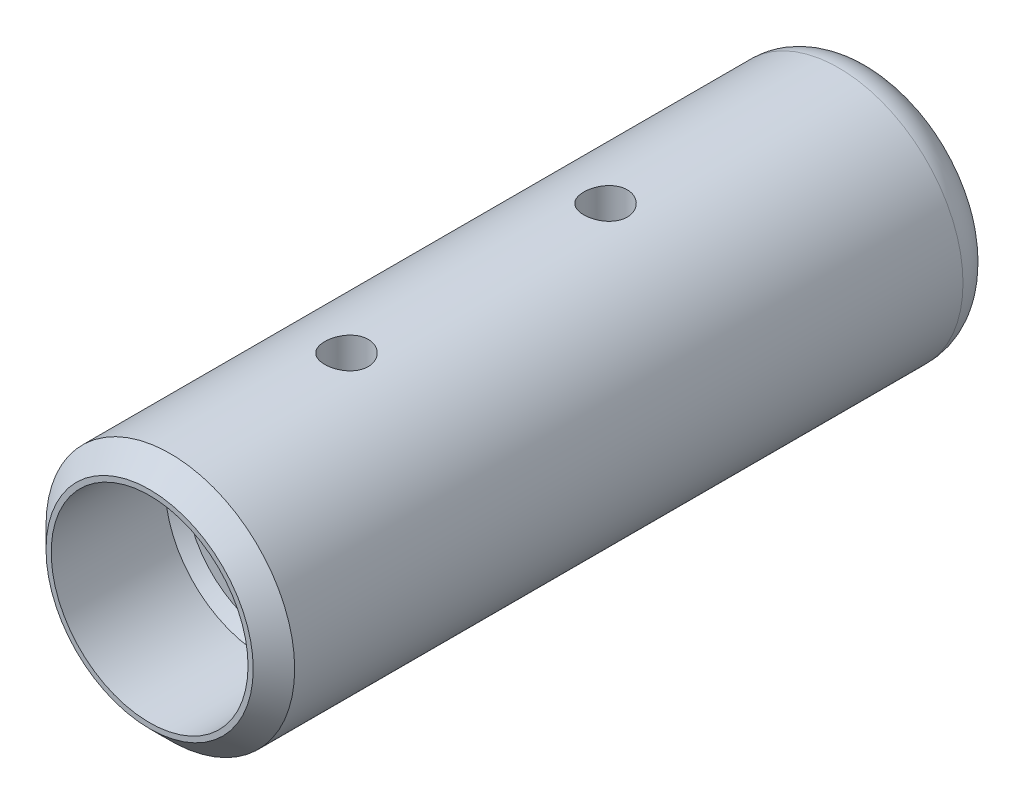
ISO-10303-21;
HEADER;
FILE_DESCRIPTION(('STEP AP214'),'2;1');
FILE_NAME('part.step','',(''),(''),'','','');
FILE_SCHEMA(('AUTOMOTIVE_DESIGN { 1 0 10303 214 1 1 1 1 }'));
ENDSEC;
DATA;
#1=APPLICATION_CONTEXT('core data for automotive mechanical design processes');
#2=APPLICATION_PROTOCOL_DEFINITION('international standard','automotive_design',2000,#1);
#3=PRODUCT_CONTEXT('',#1,'mechanical');
#4=PRODUCT('Part','Part','',(#3));
#5=PRODUCT_RELATED_PRODUCT_CATEGORY('part','',(#4));
#6=PRODUCT_DEFINITION_FORMATION('','',#4);
#7=PRODUCT_DEFINITION_CONTEXT('part definition',#1,'design');
#8=PRODUCT_DEFINITION('design','',#6,#7);
#9=PRODUCT_DEFINITION_SHAPE('','',#8);
#10=(LENGTH_UNIT() NAMED_UNIT(*) SI_UNIT(.MILLI.,.METRE.));
#11=(NAMED_UNIT(*) PLANE_ANGLE_UNIT() SI_UNIT($,.RADIAN.));
#12=(NAMED_UNIT(*) SI_UNIT($,.STERADIAN.) SOLID_ANGLE_UNIT());
#13=UNCERTAINTY_MEASURE_WITH_UNIT(LENGTH_MEASURE(1.E-05),#10,'distance_accuracy_value','');
#14=(GEOMETRIC_REPRESENTATION_CONTEXT(3) GLOBAL_UNCERTAINTY_ASSIGNED_CONTEXT((#13)) GLOBAL_UNIT_ASSIGNED_CONTEXT((#10,
#11,#12)) REPRESENTATION_CONTEXT('',''));
#15=CARTESIAN_POINT('',(0.,0.,0.));
#16=DIRECTION('',(0.,0.,1.));
#17=DIRECTION('',(1.,0.,0.));
#18=AXIS2_PLACEMENT_3D('',#15,#16,#17);
#19=CARTESIAN_POINT('',(0.,-12.001,26.));
#20=DIRECTION('',(0.,1.,0.));
#21=DIRECTION('',(0.,0.,1.));
#22=AXIS2_PLACEMENT_3D('',#19,#20,#21);
#23=CYLINDRICAL_SURFACE('',#22,2.1);
#24=CARTESIAN_POINT('',(0.,4.24999999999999,28.1));
#25=CARTESIAN_POINT('',(-0.110556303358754,4.24999410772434,28.099993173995));
#26=CARTESIAN_POINT('',(-0.221249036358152,4.2456396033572,28.0912181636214));
#27=CARTESIAN_POINT('',(-0.439372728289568,4.22864969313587,28.0565015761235));
#28=CARTESIAN_POINT('',(-0.546796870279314,4.21599807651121,28.0305263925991));
#29=CARTESIAN_POINT('',(-0.754893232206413,4.18374019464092,27.9626682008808));
#30=CARTESIAN_POINT('',(-0.855589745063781,4.16416076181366,27.9208465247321));
#31=CARTESIAN_POINT('',(-1.04839235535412,4.1198510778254,27.8227950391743));
#32=CARTESIAN_POINT('',(-1.14049926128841,4.0951213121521,27.7665665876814));
#33=CARTESIAN_POINT('',(-1.31967279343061,4.0410683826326,27.6374889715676));
#34=CARTESIAN_POINT('',(-1.40611363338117,4.01155948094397,27.5638500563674));
#35=CARTESIAN_POINT('',(-1.56599238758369,3.95189365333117,27.4037391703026));
#36=CARTESIAN_POINT('',(-1.63942064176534,3.92173626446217,27.3172577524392));
#37=CARTESIAN_POINT('',(-1.77672701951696,3.86157698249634,27.1261020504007));
#38=CARTESIAN_POINT('',(-1.83947014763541,3.83175768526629,27.0205483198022));
#39=CARTESIAN_POINT('',(-1.94604792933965,3.77875168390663,26.7987517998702));
#40=CARTESIAN_POINT('',(-1.98989585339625,3.75556032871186,26.6825165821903));
#41=CARTESIAN_POINT('',(-2.05462572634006,3.7205247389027,26.4496940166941));
#42=CARTESIAN_POINT('',(-2.07671431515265,3.7080896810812,26.3335354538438));
#43=CARTESIAN_POINT('',(-2.10100060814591,3.69438949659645,26.0985502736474));
#44=CARTESIAN_POINT('',(-2.1032171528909,3.69311378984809,25.9797262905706));
#45=CARTESIAN_POINT('',(-2.08858300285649,3.70139904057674,25.757608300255));
#46=CARTESIAN_POINT('',(-2.07391623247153,3.70971900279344,25.6541129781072));
#47=CARTESIAN_POINT('',(-2.02970634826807,3.73408927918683,25.4513023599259));
#48=CARTESIAN_POINT('',(-2.00015867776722,3.75014196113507,25.3519883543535));
#49=CARTESIAN_POINT('',(-1.92647747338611,3.78852694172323,25.1575302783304));
#50=CARTESIAN_POINT('',(-1.88201985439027,3.81099695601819,25.0625374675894));
#51=CARTESIAN_POINT('',(-1.78002709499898,3.85968828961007,24.8809090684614));
#52=CARTESIAN_POINT('',(-1.7224860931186,3.8859112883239,24.7942772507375));
#53=CARTESIAN_POINT('',(-1.58767280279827,3.94306809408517,24.6205707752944));
#54=CARTESIAN_POINT('',(-1.50884162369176,3.97418382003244,24.5347616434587));
#55=CARTESIAN_POINT('',(-1.33776426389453,4.03498810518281,24.3770617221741));
#56=CARTESIAN_POINT('',(-1.24551199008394,4.0646760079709,24.3051772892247));
#57=CARTESIAN_POINT('',(-1.04501442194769,4.12089102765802,24.1743803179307));
#58=CARTESIAN_POINT('',(-0.936241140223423,4.14721945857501,24.1161848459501));
#59=CARTESIAN_POINT('',(-0.708816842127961,4.19207213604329,24.0193896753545));
#60=CARTESIAN_POINT('',(-0.590173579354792,4.21060244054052,23.9807747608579));
#61=CARTESIAN_POINT('',(-0.356749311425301,4.23649382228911,23.927350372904));
#62=CARTESIAN_POINT('',(-0.242441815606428,4.24464222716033,23.9108569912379));
#63=CARTESIAN_POINT('',(-0.0124076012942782,4.25153643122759,23.8968820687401));
#64=CARTESIAN_POINT('',(0.103318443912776,4.25028653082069,23.8993918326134));
#65=CARTESIAN_POINT('',(0.323645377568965,4.2389874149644,23.9223580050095));
#66=CARTESIAN_POINT('',(0.428427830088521,4.22960785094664,23.9414488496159));
#67=CARTESIAN_POINT('',(0.633098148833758,4.20384711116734,23.9949120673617));
#68=CARTESIAN_POINT('',(0.732985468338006,4.18746515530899,24.0292861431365));
#69=CARTESIAN_POINT('',(0.92838373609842,4.1485927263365,24.1132714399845));
#70=CARTESIAN_POINT('',(1.0236830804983,4.12593853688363,24.1632965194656));
#71=CARTESIAN_POINT('',(1.20485501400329,4.07672066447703,24.2767009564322));
#72=CARTESIAN_POINT('',(1.29072352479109,4.05015530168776,24.340086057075));
#73=CARTESIAN_POINT('',(1.45937102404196,3.99267049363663,24.48547151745));
#74=CARTESIAN_POINT('',(1.54105377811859,3.96157820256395,24.5686774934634));
#75=CARTESIAN_POINT('',(1.68977840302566,3.90046500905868,24.7477198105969));
#76=CARTESIAN_POINT('',(1.75681073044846,3.87044481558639,24.8435643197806));
#77=CARTESIAN_POINT('',(1.8771744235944,3.81357505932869,25.050686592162));
#78=CARTESIAN_POINT('',(1.92974592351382,3.78693122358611,25.1624673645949));
#79=CARTESIAN_POINT('',(2.01476877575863,3.7423983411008,25.395033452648));
#80=CARTESIAN_POINT('',(2.04724544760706,3.72449828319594,25.5158072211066));
#81=CARTESIAN_POINT('',(2.08821208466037,3.70167136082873,25.7506176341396));
#82=CARTESIAN_POINT('',(2.09869132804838,3.69567163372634,25.8642010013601));
#83=CARTESIAN_POINT('',(2.10107617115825,3.69431841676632,26.0916066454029));
#84=CARTESIAN_POINT('',(2.09298921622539,3.69896065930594,26.205428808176));
#85=CARTESIAN_POINT('',(2.06031975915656,3.71724005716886,26.4191721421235));
#86=CARTESIAN_POINT('',(2.03730586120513,3.7300199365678,26.5194155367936));
#87=CARTESIAN_POINT('',(1.97734260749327,3.76214915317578,26.7145203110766));
#88=CARTESIAN_POINT('',(1.94038884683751,3.78150056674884,26.809379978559));
#89=CARTESIAN_POINT('',(1.85080461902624,3.82618379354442,26.9980765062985));
#90=CARTESIAN_POINT('',(1.79728696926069,3.85183028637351,27.0914155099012));
#91=CARTESIAN_POINT('',(1.6770911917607,3.90566263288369,27.2683930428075));
#92=CARTESIAN_POINT('',(1.61040631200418,3.93384978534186,27.352026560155));
#93=CARTESIAN_POINT('',(1.45656351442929,3.99355696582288,27.517442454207));
#94=CARTESIAN_POINT('',(1.36792010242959,4.02507904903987,27.5978500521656));
#95=CARTESIAN_POINT('',(1.17749087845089,4.08484591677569,27.7429407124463));
#96=CARTESIAN_POINT('',(1.07569821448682,4.11308897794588,27.8076155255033));
#97=CARTESIAN_POINT('',(0.860781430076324,4.16338652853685,27.9193197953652));
#98=CARTESIAN_POINT('',(0.747607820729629,4.18541225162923,27.9662675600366));
#99=CARTESIAN_POINT('',(0.513710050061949,4.2204831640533,28.0398624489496));
#100=CARTESIAN_POINT('',(0.393008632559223,4.23355409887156,28.0665677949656));
#101=CARTESIAN_POINT('',(0.225925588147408,4.24423155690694,28.0883046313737));
#102=CARTESIAN_POINT('',(0.180887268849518,4.24638934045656,28.0926844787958));
#103=CARTESIAN_POINT('',(0.0905736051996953,4.24927478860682,28.0985336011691));
#104=CARTESIAN_POINT('',(0.0452982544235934,4.25000241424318,28.1000027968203));
#105=CARTESIAN_POINT('',(0.,4.24999999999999,28.1));
#106=B_SPLINE_CURVE_WITH_KNOTS('',3,(#24,#25,#26,#27,#28,#29,#30,#31,#32,#33,#34,#35,#36,#37,
#38,#39,#40,#41,#42,#43,#44,#45,#46,#47,#48,#49,#50,#51,#52,#53,#54,#55,#56,#57,#58,#59,#60,#61,
#62,#63,#64,#65,#66,#67,#68,#69,#70,#71,#72,#73,#74,#75,#76,#77,#78,#79,#80,#81,#82,#83,#84,#85,
#86,#87,#88,#89,#90,#91,#92,#93,#94,#95,#96,#97,#98,#99,#100,#101,#102,#103,#104,#105),
.UNSPECIFIED.,.T.,.F.,(4,2,2,2,2,2,2,2,2,2,2,2,2,2,2,2,2,2,2,2,2,2,2,2,2,2,2,2,2,2,2,2,2,2,2,2,
2,2,2,2,4),(0.,0.331484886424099,0.663619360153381,0.994481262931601,1.3253119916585,
1.67582318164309,2.02659349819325,2.4037687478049,2.78067866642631,3.13526013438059,
3.48950539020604,3.80262095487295,4.11583245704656,4.43634832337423,4.75700806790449,
5.11725224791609,5.47766049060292,5.8540597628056,6.23016608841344,6.57561427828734,
6.92090441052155,7.24019511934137,7.55952140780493,7.88812961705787,8.21687937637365,
8.5773278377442,8.93801040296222,9.31506208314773,9.69163770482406,10.032361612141,
10.3729489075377,10.6825324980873,10.9922139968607,11.3227230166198,11.6534019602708,
12.0229757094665,12.3927428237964,12.7641937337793,13.1345721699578,13.2703878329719,
13.406207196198),.UNSPECIFIED.);
#107=CARTESIAN_POINT('',(0.,4.24999999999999,28.1));
#108=VERTEX_POINT('',#107);
#109=EDGE_CURVE('E67',#108,#108,#106,.T.);
#110=ORIENTED_EDGE('',*,*,#109,.T.);
#111=EDGE_LOOP('',(#110));
#112=FACE_BOUND('',#111,.T.);
#113=CARTESIAN_POINT('',(0.,12.,28.1));
#114=CARTESIAN_POINT('',(-0.117000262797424,11.9999979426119,28.0999953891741));
#115=CARTESIAN_POINT('',(-0.234062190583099,11.9982711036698,28.0901890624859));
#116=CARTESIAN_POINT('',(-0.464896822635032,11.9915487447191,28.051242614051));
#117=CARTESIAN_POINT('',(-0.578666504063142,11.9865503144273,28.0220852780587));
#118=CARTESIAN_POINT('',(-0.799544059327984,11.9738448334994,27.945349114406));
#119=CARTESIAN_POINT('',(-0.906657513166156,11.9661400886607,27.897785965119));
#120=CARTESIAN_POINT('',(-1.1113715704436,11.948866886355,27.7856307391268));
#121=CARTESIAN_POINT('',(-1.20897313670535,11.9392986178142,27.7210403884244));
#122=CARTESIAN_POINT('',(-1.39292949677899,11.9192450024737,27.5759436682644));
#123=CARTESIAN_POINT('',(-1.47916997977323,11.9087518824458,27.4952934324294));
#124=CARTESIAN_POINT('',(-1.63696811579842,11.8880899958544,27.3206759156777));
#125=CARTESIAN_POINT('',(-1.7085247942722,11.8779212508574,27.2267077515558));
#126=CARTESIAN_POINT('',(-1.83538895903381,11.8589841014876,27.0273277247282));
#127=CARTESIAN_POINT('',(-1.89058214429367,11.8502257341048,26.9218420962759));
#128=CARTESIAN_POINT('',(-1.98242136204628,11.8352095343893,26.7029175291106));
#129=CARTESIAN_POINT('',(-2.01906877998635,11.8289515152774,26.5894791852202));
#130=CARTESIAN_POINT('',(-2.07241339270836,11.8197223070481,26.3590855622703));
#131=CARTESIAN_POINT('',(-2.08930873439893,11.8167184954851,26.2421774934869));
#132=CARTESIAN_POINT('',(-2.10328422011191,11.8142392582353,26.0071502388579));
#133=CARTESIAN_POINT('',(-2.1003659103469,11.8147635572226,25.889031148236));
#134=CARTESIAN_POINT('',(-2.07495804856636,11.8192515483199,25.6563573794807));
#135=CARTESIAN_POINT('',(-2.05269213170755,11.8231759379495,25.5417774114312));
#136=CARTESIAN_POINT('',(-1.98957253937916,11.8339603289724,25.3180049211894));
#137=CARTESIAN_POINT('',(-1.94871816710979,11.8408204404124,25.2088126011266));
#138=CARTESIAN_POINT('',(-1.84935775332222,11.8567452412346,24.9982513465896));
#139=CARTESIAN_POINT('',(-1.7907598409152,11.8658213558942,24.8969266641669));
#140=CARTESIAN_POINT('',(-1.65764085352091,11.8851477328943,24.7054635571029));
#141=CARTESIAN_POINT('',(-1.58311836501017,11.8953980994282,24.6153261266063));
#142=CARTESIAN_POINT('',(-1.41905208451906,11.916090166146,24.4475025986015));
#143=CARTESIAN_POINT('',(-1.32931664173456,11.9265325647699,24.3700038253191));
#144=CARTESIAN_POINT('',(-1.13801721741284,11.9463027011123,24.2311340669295));
#145=CARTESIAN_POINT('',(-1.03645314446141,11.9556304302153,24.1697632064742));
#146=CARTESIAN_POINT('',(-0.824195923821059,11.972135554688,24.0648702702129));
#147=CARTESIAN_POINT('',(-0.71349386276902,11.9793108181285,24.0213658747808));
#148=CARTESIAN_POINT('',(-0.486200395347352,11.9906857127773,23.9536206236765));
#149=CARTESIAN_POINT('',(-0.369609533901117,11.9948856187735,23.9293779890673));
#150=CARTESIAN_POINT('',(-0.135461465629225,11.9997993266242,23.9011009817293));
#151=CARTESIAN_POINT('',(-0.0179361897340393,12.0005574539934,23.8968096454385));
#152=CARTESIAN_POINT('',(0.216153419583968,11.99862398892,23.9078703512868));
#153=CARTESIAN_POINT('',(0.332717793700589,11.9959325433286,23.9232215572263));
#154=CARTESIAN_POINT('',(0.560774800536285,11.9874298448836,23.9729178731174));
#155=CARTESIAN_POINT('',(0.672296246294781,11.9816396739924,24.0071346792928));
#156=CARTESIAN_POINT('',(0.88801979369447,11.9675860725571,24.0934533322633));
#157=CARTESIAN_POINT('',(0.992221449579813,11.9593224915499,24.145556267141));
#158=CARTESIAN_POINT('',(1.19145617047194,11.9411284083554,24.2667490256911));
#159=CARTESIAN_POINT('',(1.28639098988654,11.9311825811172,24.3359980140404));
#160=CARTESIAN_POINT('',(1.46338441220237,11.9107706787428,24.4892996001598));
#161=CARTESIAN_POINT('',(1.54544197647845,11.9003045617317,24.5733533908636));
#162=CARTESIAN_POINT('',(1.69531337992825,11.8798868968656,24.7550353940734));
#163=CARTESIAN_POINT('',(1.76295290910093,11.8699426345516,24.8528083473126));
#164=CARTESIAN_POINT('',(1.88084768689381,11.851834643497,25.0584797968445));
#165=CARTESIAN_POINT('',(1.93110352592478,11.8436708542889,25.1663779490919));
#166=CARTESIAN_POINT('',(2.01254884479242,11.8301037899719,25.3887669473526));
#167=CARTESIAN_POINT('',(2.04382242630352,11.8246883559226,25.5032262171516));
#168=CARTESIAN_POINT('',(2.08667824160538,11.8172016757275,25.735876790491));
#169=CARTESIAN_POINT('',(2.09826238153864,11.8151301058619,25.8540677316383));
#170=CARTESIAN_POINT('',(2.10135318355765,11.8145806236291,26.0890840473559));
#171=CARTESIAN_POINT('',(2.09313442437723,11.8160535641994,26.2059057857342));
#172=CARTESIAN_POINT('',(2.05744932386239,11.8223189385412,26.4364761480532));
#173=CARTESIAN_POINT('',(2.02998306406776,11.8271113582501,26.5502247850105));
#174=CARTESIAN_POINT('',(1.95669201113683,11.8394562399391,26.7712977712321));
#175=CARTESIAN_POINT('',(1.91089322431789,11.8470047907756,26.8786309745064));
#176=CARTESIAN_POINT('',(1.80226602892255,11.8640147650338,27.0841345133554));
#177=CARTESIAN_POINT('',(1.73943663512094,11.8734762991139,27.1823043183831));
#178=CARTESIAN_POINT('',(1.59756152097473,11.8934007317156,27.3680771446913));
#179=CARTESIAN_POINT('',(1.51831461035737,11.903875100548,27.4555253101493));
#180=CARTESIAN_POINT('',(1.34627665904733,11.9245557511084,27.6159754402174));
#181=CARTESIAN_POINT('',(1.25348250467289,11.9347619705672,27.688974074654));
#182=CARTESIAN_POINT('',(1.05613222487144,11.9538478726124,27.8189712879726));
#183=CARTESIAN_POINT('',(0.951491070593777,11.9627167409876,27.8758423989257));
#184=CARTESIAN_POINT('',(0.734023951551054,11.9780234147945,27.9711095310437));
#185=CARTESIAN_POINT('',(0.621206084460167,11.9844635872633,28.0095235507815));
#186=CARTESIAN_POINT('',(0.423324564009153,11.9928172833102,28.0586546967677));
#187=CARTESIAN_POINT('',(0.339443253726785,11.9954960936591,28.0741337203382));
#188=CARTESIAN_POINT('',(0.170385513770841,11.9990881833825,28.0948079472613));
#189=CARTESIAN_POINT('',(0.0852091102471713,12.0000014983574,28.1000033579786));
#190=CARTESIAN_POINT('',(0.,12.,28.1));
#191=B_SPLINE_CURVE_WITH_KNOTS('',3,(#113,#114,#115,#116,#117,#118,#119,#120,#121,#122,#123,
#124,#125,#126,#127,#128,#129,#130,#131,#132,#133,#134,#135,#136,#137,#138,#139,#140,#141,#142,
#143,#144,#145,#146,#147,#148,#149,#150,#151,#152,#153,#154,#155,#156,#157,#158,#159,#160,#161,
#162,#163,#164,#165,#166,#167,#168,#169,#170,#171,#172,#173,#174,#175,#176,#177,#178,#179,#180,
#181,#182,#183,#184,#185,#186,#187,#188,#189,#190),.UNSPECIFIED.,.T.,.F.,(4,2,2,2,2,2,2,2,2,2,2,
2,2,2,2,2,2,2,2,2,2,2,2,2,2,2,2,2,2,2,2,2,2,2,2,2,2,2,4),(0.,0.350689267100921,0.70169091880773,
1.05239423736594,1.40306201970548,1.75702519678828,2.11101185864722,2.46741585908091,
2.82379323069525,3.17656399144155,3.52930722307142,3.87802660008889,4.22675905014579,
4.57732894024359,4.9279299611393,5.28333005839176,5.63873290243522,5.99448660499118,
6.35020744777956,6.70133383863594,7.05244528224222,7.40119777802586,7.74997149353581,
8.10211290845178,8.45428271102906,8.81049493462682,9.16669505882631,9.52130527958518,
9.87588116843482,10.2255690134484,10.5752553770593,10.9244474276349,11.2736596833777,
11.6274355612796,11.9812928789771,12.3378736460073,12.6941059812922,12.9495115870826,
13.2049120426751),.UNSPECIFIED.);
#192=CARTESIAN_POINT('',(0.,12.,28.1));
#193=VERTEX_POINT('',#192);
#194=EDGE_CURVE('E127',#193,#193,#191,.T.);
#195=ORIENTED_EDGE('',*,*,#194,.F.);
#196=EDGE_LOOP('',(#195));
#197=FACE_BOUND('',#196,.T.);
#198=ADVANCED_FACE('F45',(#112,#197),#23,.F.);
#199=CARTESIAN_POINT('',(0.,-12.001,51.));
#200=DIRECTION('',(0.,1.,0.));
#201=DIRECTION('',(0.,0.,1.));
#202=AXIS2_PLACEMENT_3D('',#199,#200,#201);
#203=CYLINDRICAL_SURFACE('',#202,2.1);
#204=CARTESIAN_POINT('',(0.,4.24999999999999,53.1));
#205=CARTESIAN_POINT('',(-0.110556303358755,4.24999410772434,53.099993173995));
#206=CARTESIAN_POINT('',(-0.221249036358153,4.2456396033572,53.0912181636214));
#207=CARTESIAN_POINT('',(-0.439372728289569,4.22864969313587,53.0565015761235));
#208=CARTESIAN_POINT('',(-0.546796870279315,4.21599807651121,53.0305263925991));
#209=CARTESIAN_POINT('',(-0.754893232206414,4.18374019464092,52.9626682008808));
#210=CARTESIAN_POINT('',(-0.85558974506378,4.16416076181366,52.9208465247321));
#211=CARTESIAN_POINT('',(-1.04839235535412,4.1198510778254,52.8227950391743));
#212=CARTESIAN_POINT('',(-1.14049926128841,4.0951213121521,52.7665665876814));
#213=CARTESIAN_POINT('',(-1.31967279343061,4.0410683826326,52.6374889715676));
#214=CARTESIAN_POINT('',(-1.40611363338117,4.01155948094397,52.5638500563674));
#215=CARTESIAN_POINT('',(-1.56599238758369,3.95189365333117,52.4037391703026));
#216=CARTESIAN_POINT('',(-1.63942064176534,3.92173626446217,52.3172577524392));
#217=CARTESIAN_POINT('',(-1.77672701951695,3.86157698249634,52.1261020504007));
#218=CARTESIAN_POINT('',(-1.8394701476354,3.83175768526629,52.0205483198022));
#219=CARTESIAN_POINT('',(-1.94604792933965,3.77875168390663,51.7987517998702));
#220=CARTESIAN_POINT('',(-1.98989585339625,3.75556032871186,51.6825165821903));
#221=CARTESIAN_POINT('',(-2.05462572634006,3.7205247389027,51.4496940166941));
#222=CARTESIAN_POINT('',(-2.07671431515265,3.7080896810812,51.3335354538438));
#223=CARTESIAN_POINT('',(-2.10100060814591,3.69438949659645,51.0985502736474));
#224=CARTESIAN_POINT('',(-2.1032171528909,3.69311378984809,50.9797262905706));
#225=CARTESIAN_POINT('',(-2.08858300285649,3.70139904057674,50.757608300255));
#226=CARTESIAN_POINT('',(-2.07391623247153,3.70971900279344,50.6541129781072));
#227=CARTESIAN_POINT('',(-2.02970634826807,3.73408927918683,50.4513023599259));
#228=CARTESIAN_POINT('',(-2.00015867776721,3.75014196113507,50.3519883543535));
#229=CARTESIAN_POINT('',(-1.92647747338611,3.78852694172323,50.1575302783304));
#230=CARTESIAN_POINT('',(-1.88201985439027,3.81099695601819,50.0625374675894));
#231=CARTESIAN_POINT('',(-1.78002709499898,3.85968828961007,49.8809090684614));
#232=CARTESIAN_POINT('',(-1.7224860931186,3.8859112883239,49.7942772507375));
#233=CARTESIAN_POINT('',(-1.58767280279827,3.94306809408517,49.6205707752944));
#234=CARTESIAN_POINT('',(-1.50884162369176,3.97418382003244,49.5347616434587));
#235=CARTESIAN_POINT('',(-1.33776426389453,4.03498810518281,49.3770617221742));
#236=CARTESIAN_POINT('',(-1.24551199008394,4.0646760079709,49.3051772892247));
#237=CARTESIAN_POINT('',(-1.04501442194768,4.12089102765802,49.1743803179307));
#238=CARTESIAN_POINT('',(-0.936241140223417,4.14721945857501,49.1161848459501));
#239=CARTESIAN_POINT('',(-0.708816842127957,4.19207213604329,49.0193896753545));
#240=CARTESIAN_POINT('',(-0.590173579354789,4.21060244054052,48.9807747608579));
#241=CARTESIAN_POINT('',(-0.356749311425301,4.23649382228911,48.927350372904));
#242=CARTESIAN_POINT('',(-0.242441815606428,4.24464222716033,48.9108569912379));
#243=CARTESIAN_POINT('',(-0.0124076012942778,4.25153643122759,48.8968820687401));
#244=CARTESIAN_POINT('',(0.103318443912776,4.25028653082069,48.8993918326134));
#245=CARTESIAN_POINT('',(0.323645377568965,4.2389874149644,48.9223580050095));
#246=CARTESIAN_POINT('',(0.428427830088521,4.22960785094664,48.9414488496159));
#247=CARTESIAN_POINT('',(0.633098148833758,4.20384711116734,48.9949120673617));
#248=CARTESIAN_POINT('',(0.732985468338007,4.18746515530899,49.0292861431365));
#249=CARTESIAN_POINT('',(0.92838373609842,4.1485927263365,49.1132714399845));
#250=CARTESIAN_POINT('',(1.0236830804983,4.12593853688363,49.1632965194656));
#251=CARTESIAN_POINT('',(1.20485501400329,4.07672066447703,49.2767009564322));
#252=CARTESIAN_POINT('',(1.29072352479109,4.05015530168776,49.340086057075));
#253=CARTESIAN_POINT('',(1.45937102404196,3.99267049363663,49.48547151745));
#254=CARTESIAN_POINT('',(1.54105377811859,3.96157820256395,49.5686774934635));
#255=CARTESIAN_POINT('',(1.68977840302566,3.90046500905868,49.7477198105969));
#256=CARTESIAN_POINT('',(1.75681073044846,3.87044481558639,49.8435643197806));
#257=CARTESIAN_POINT('',(1.87717442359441,3.81357505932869,50.050686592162));
#258=CARTESIAN_POINT('',(1.92974592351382,3.78693122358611,50.1624673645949));
#259=CARTESIAN_POINT('',(2.01476877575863,3.7423983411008,50.395033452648));
#260=CARTESIAN_POINT('',(2.04724544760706,3.72449828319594,50.5158072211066));
#261=CARTESIAN_POINT('',(2.08821208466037,3.70167136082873,50.7506176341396));
#262=CARTESIAN_POINT('',(2.09869132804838,3.69567163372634,50.8642010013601));
#263=CARTESIAN_POINT('',(2.10107617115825,3.69431841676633,51.0916066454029));
#264=CARTESIAN_POINT('',(2.09298921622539,3.69896065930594,51.205428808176));
#265=CARTESIAN_POINT('',(2.06031975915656,3.71724005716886,51.4191721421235));
#266=CARTESIAN_POINT('',(2.03730586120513,3.7300199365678,51.5194155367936));
#267=CARTESIAN_POINT('',(1.97734260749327,3.76214915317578,51.7145203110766));
#268=CARTESIAN_POINT('',(1.94038884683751,3.78150056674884,51.809379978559));
#269=CARTESIAN_POINT('',(1.85080461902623,3.82618379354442,51.9980765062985));
#270=CARTESIAN_POINT('',(1.79728696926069,3.85183028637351,52.0914155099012));
#271=CARTESIAN_POINT('',(1.67709119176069,3.90566263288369,52.2683930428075));
#272=CARTESIAN_POINT('',(1.61040631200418,3.93384978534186,52.352026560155));
#273=CARTESIAN_POINT('',(1.45656351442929,3.99355696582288,52.517442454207));
#274=CARTESIAN_POINT('',(1.36792010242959,4.02507904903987,52.5978500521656));
#275=CARTESIAN_POINT('',(1.17749087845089,4.08484591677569,52.7429407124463));
#276=CARTESIAN_POINT('',(1.07569821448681,4.11308897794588,52.8076155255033));
#277=CARTESIAN_POINT('',(0.860781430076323,4.16338652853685,52.9193197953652));
#278=CARTESIAN_POINT('',(0.747607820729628,4.18541225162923,52.9662675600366));
#279=CARTESIAN_POINT('',(0.513710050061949,4.2204831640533,53.0398624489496));
#280=CARTESIAN_POINT('',(0.393008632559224,4.23355409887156,53.0665677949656));
#281=CARTESIAN_POINT('',(0.225925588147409,4.24423155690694,53.0883046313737));
#282=CARTESIAN_POINT('',(0.180887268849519,4.24638934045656,53.0926844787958));
#283=CARTESIAN_POINT('',(0.0905736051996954,4.24927478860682,53.0985336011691));
#284=CARTESIAN_POINT('',(0.0452982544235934,4.25000241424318,53.1000027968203));
#285=CARTESIAN_POINT('',(0.,4.24999999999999,53.1));
#286=B_SPLINE_CURVE_WITH_KNOTS('',3,(#204,#205,#206,#207,#208,#209,#210,#211,#212,#213,#214,
#215,#216,#217,#218,#219,#220,#221,#222,#223,#224,#225,#226,#227,#228,#229,#230,#231,#232,#233,
#234,#235,#236,#237,#238,#239,#240,#241,#242,#243,#244,#245,#246,#247,#248,#249,#250,#251,#252,
#253,#254,#255,#256,#257,#258,#259,#260,#261,#262,#263,#264,#265,#266,#267,#268,#269,#270,#271,
#272,#273,#274,#275,#276,#277,#278,#279,#280,#281,#282,#283,#284,#285),.UNSPECIFIED.,.T.,.F.,(4,
2,2,2,2,2,2,2,2,2,2,2,2,2,2,2,2,2,2,2,2,2,2,2,2,2,2,2,2,2,2,2,2,2,2,2,2,2,2,2,4),(0.,
0.3314848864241,0.66361936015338,0.994481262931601,1.3253119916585,1.6758231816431,
2.02659349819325,2.40376874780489,2.78067866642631,3.13526013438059,3.48950539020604,
3.80262095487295,4.11583245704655,4.43634832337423,4.75700806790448,5.11725224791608,
5.47766049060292,5.8540597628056,6.23016608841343,6.57561427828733,6.92090441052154,
7.24019511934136,7.55952140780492,7.88812961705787,8.21687937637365,8.5773278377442,
8.93801040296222,9.31506208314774,9.69163770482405,10.032361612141,10.3729489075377,
10.6825324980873,10.9922139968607,11.3227230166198,11.6534019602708,12.0229757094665,
12.3927428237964,12.7641937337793,13.1345721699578,13.2703878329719,13.406207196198),.UNSPECIFIED.);
#287=CARTESIAN_POINT('',(0.,4.24999999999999,53.1));
#288=VERTEX_POINT('',#287);
#289=EDGE_CURVE('E75',#288,#288,#286,.T.);
#290=ORIENTED_EDGE('',*,*,#289,.T.);
#291=EDGE_LOOP('',(#290));
#292=FACE_BOUND('',#291,.T.);
#293=CARTESIAN_POINT('',(0.,12.,53.1));
#294=CARTESIAN_POINT('',(-0.117000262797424,11.9999979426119,53.0999953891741));
#295=CARTESIAN_POINT('',(-0.234062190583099,11.9982711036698,53.0901890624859));
#296=CARTESIAN_POINT('',(-0.464896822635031,11.9915487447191,53.051242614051));
#297=CARTESIAN_POINT('',(-0.578666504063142,11.9865503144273,53.0220852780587));
#298=CARTESIAN_POINT('',(-0.799544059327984,11.9738448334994,52.945349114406));
#299=CARTESIAN_POINT('',(-0.906657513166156,11.9661400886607,52.897785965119));
#300=CARTESIAN_POINT('',(-1.1113715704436,11.948866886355,52.7856307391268));
#301=CARTESIAN_POINT('',(-1.20897313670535,11.9392986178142,52.7210403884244));
#302=CARTESIAN_POINT('',(-1.39292949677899,11.9192450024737,52.5759436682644));
#303=CARTESIAN_POINT('',(-1.47916997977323,11.9087518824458,52.4952934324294));
#304=CARTESIAN_POINT('',(-1.63696811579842,11.8880899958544,52.3206759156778));
#305=CARTESIAN_POINT('',(-1.7085247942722,11.8779212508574,52.2267077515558));
#306=CARTESIAN_POINT('',(-1.83538895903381,11.8589841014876,52.0273277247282));
#307=CARTESIAN_POINT('',(-1.89058214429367,11.8502257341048,51.9218420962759));
#308=CARTESIAN_POINT('',(-1.98242136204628,11.8352095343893,51.7029175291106));
#309=CARTESIAN_POINT('',(-2.01906877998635,11.8289515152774,51.5894791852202));
#310=CARTESIAN_POINT('',(-2.07241339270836,11.8197223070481,51.3590855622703));
#311=CARTESIAN_POINT('',(-2.08930873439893,11.8167184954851,51.2421774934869));
#312=CARTESIAN_POINT('',(-2.10328422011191,11.8142392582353,51.0071502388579));
#313=CARTESIAN_POINT('',(-2.1003659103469,11.8147635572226,50.889031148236));
#314=CARTESIAN_POINT('',(-2.07495804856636,11.8192515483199,50.6563573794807));
#315=CARTESIAN_POINT('',(-2.05269213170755,11.8231759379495,50.5417774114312));
#316=CARTESIAN_POINT('',(-1.98957253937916,11.8339603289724,50.3180049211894));
#317=CARTESIAN_POINT('',(-1.94871816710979,11.8408204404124,50.2088126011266));
#318=CARTESIAN_POINT('',(-1.84935775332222,11.8567452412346,49.9982513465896));
#319=CARTESIAN_POINT('',(-1.7907598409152,11.8658213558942,49.8969266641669));
#320=CARTESIAN_POINT('',(-1.65764085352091,11.8851477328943,49.7054635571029));
#321=CARTESIAN_POINT('',(-1.58311836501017,11.8953980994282,49.6153261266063));
#322=CARTESIAN_POINT('',(-1.41905208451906,11.916090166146,49.4475025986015));
#323=CARTESIAN_POINT('',(-1.32931664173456,11.9265325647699,49.3700038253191));
#324=CARTESIAN_POINT('',(-1.13801721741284,11.9463027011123,49.2311340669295));
#325=CARTESIAN_POINT('',(-1.03645314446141,11.9556304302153,49.1697632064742));
#326=CARTESIAN_POINT('',(-0.824195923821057,11.972135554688,49.0648702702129));
#327=CARTESIAN_POINT('',(-0.713493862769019,11.9793108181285,49.0213658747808));
#328=CARTESIAN_POINT('',(-0.486200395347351,11.9906857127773,48.9536206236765));
#329=CARTESIAN_POINT('',(-0.369609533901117,11.9948856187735,48.9293779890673));
#330=CARTESIAN_POINT('',(-0.135461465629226,11.9997993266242,48.9011009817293));
#331=CARTESIAN_POINT('',(-0.0179361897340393,12.0005574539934,48.8968096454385));
#332=CARTESIAN_POINT('',(0.216153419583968,11.99862398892,48.9078703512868));
#333=CARTESIAN_POINT('',(0.332717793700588,11.9959325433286,48.9232215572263));
#334=CARTESIAN_POINT('',(0.560774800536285,11.9874298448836,48.9729178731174));
#335=CARTESIAN_POINT('',(0.672296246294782,11.9816396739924,49.0071346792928));
#336=CARTESIAN_POINT('',(0.888019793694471,11.9675860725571,49.0934533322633));
#337=CARTESIAN_POINT('',(0.992221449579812,11.9593224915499,49.145556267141));
#338=CARTESIAN_POINT('',(1.19145617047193,11.9411284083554,49.2667490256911));
#339=CARTESIAN_POINT('',(1.28639098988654,11.9311825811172,49.3359980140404));
#340=CARTESIAN_POINT('',(1.46338441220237,11.9107706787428,49.4892996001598));
#341=CARTESIAN_POINT('',(1.54544197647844,11.9003045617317,49.5733533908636));
#342=CARTESIAN_POINT('',(1.69531337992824,11.8798868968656,49.7550353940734));
#343=CARTESIAN_POINT('',(1.76295290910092,11.8699426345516,49.8528083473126));
#344=CARTESIAN_POINT('',(1.8808476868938,11.851834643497,50.0584797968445));
#345=CARTESIAN_POINT('',(1.93110352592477,11.8436708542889,50.1663779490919));
#346=CARTESIAN_POINT('',(2.01254884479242,11.8301037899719,50.3887669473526));
#347=CARTESIAN_POINT('',(2.04382242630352,11.8246883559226,50.5032262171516));
#348=CARTESIAN_POINT('',(2.08667824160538,11.8172016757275,50.735876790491));
#349=CARTESIAN_POINT('',(2.09826238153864,11.8151301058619,50.8540677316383));
#350=CARTESIAN_POINT('',(2.10135318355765,11.8145806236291,51.0890840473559));
#351=CARTESIAN_POINT('',(2.09313442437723,11.8160535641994,51.2059057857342));
#352=CARTESIAN_POINT('',(2.05744932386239,11.8223189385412,51.4364761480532));
#353=CARTESIAN_POINT('',(2.02998306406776,11.8271113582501,51.5502247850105));
#354=CARTESIAN_POINT('',(1.95669201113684,11.8394562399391,51.7712977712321));
#355=CARTESIAN_POINT('',(1.9108932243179,11.8470047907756,51.8786309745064));
#356=CARTESIAN_POINT('',(1.80226602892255,11.8640147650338,52.0841345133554));
#357=CARTESIAN_POINT('',(1.73943663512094,11.8734762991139,52.1823043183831));
#358=CARTESIAN_POINT('',(1.59756152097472,11.8934007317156,52.3680771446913));
#359=CARTESIAN_POINT('',(1.51831461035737,11.903875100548,52.4555253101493));
#360=CARTESIAN_POINT('',(1.34627665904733,11.9245557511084,52.6159754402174));
#361=CARTESIAN_POINT('',(1.25348250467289,11.9347619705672,52.688974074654));
#362=CARTESIAN_POINT('',(1.05613222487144,11.9538478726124,52.8189712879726));
#363=CARTESIAN_POINT('',(0.951491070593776,11.9627167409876,52.8758423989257));
#364=CARTESIAN_POINT('',(0.734023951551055,11.9780234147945,52.9711095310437));
#365=CARTESIAN_POINT('',(0.62120608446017,11.9844635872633,53.0095235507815));
#366=CARTESIAN_POINT('',(0.423324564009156,11.9928172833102,53.0586546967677));
#367=CARTESIAN_POINT('',(0.339443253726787,11.9954960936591,53.0741337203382));
#368=CARTESIAN_POINT('',(0.170385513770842,11.9990881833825,53.0948079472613));
#369=CARTESIAN_POINT('',(0.0852091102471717,12.0000014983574,53.1000033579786));
#370=CARTESIAN_POINT('',(0.,12.,53.1));
#371=B_SPLINE_CURVE_WITH_KNOTS('',3,(#293,#294,#295,#296,#297,#298,#299,#300,#301,#302,#303,
#304,#305,#306,#307,#308,#309,#310,#311,#312,#313,#314,#315,#316,#317,#318,#319,#320,#321,#322,
#323,#324,#325,#326,#327,#328,#329,#330,#331,#332,#333,#334,#335,#336,#337,#338,#339,#340,#341,
#342,#343,#344,#345,#346,#347,#348,#349,#350,#351,#352,#353,#354,#355,#356,#357,#358,#359,#360,
#361,#362,#363,#364,#365,#366,#367,#368,#369,#370),.UNSPECIFIED.,.T.,.F.,(4,2,2,2,2,2,2,2,2,2,2,
2,2,2,2,2,2,2,2,2,2,2,2,2,2,2,2,2,2,2,2,2,2,2,2,2,2,2,4),(0.,0.35068926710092,0.701690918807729,
1.05239423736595,1.40306201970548,1.75702519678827,2.11101185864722,2.46741585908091,
2.82379323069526,3.17656399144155,3.52930722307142,3.87802660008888,4.22675905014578,
4.57732894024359,4.92792996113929,5.28333005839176,5.63873290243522,5.99448660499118,
6.35020744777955,6.70133383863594,7.05244528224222,7.40119777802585,7.7499714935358,
8.10211290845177,8.45428271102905,8.8104949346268,9.16669505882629,9.52130527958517,
9.87588116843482,10.2255690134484,10.5752553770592,10.9244474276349,11.2736596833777,
11.6274355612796,11.9812928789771,12.3378736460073,12.6941059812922,12.9495115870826,
13.2049120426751),.UNSPECIFIED.);
#372=CARTESIAN_POINT('',(0.,12.,53.1));
#373=VERTEX_POINT('',#372);
#374=EDGE_CURVE('E135',#373,#373,#371,.T.);
#375=ORIENTED_EDGE('',*,*,#374,.F.);
#376=EDGE_LOOP('',(#375));
#377=FACE_BOUND('',#376,.T.);
#378=ADVANCED_FACE('F114',(#292,#377),#203,.F.);
#379=CARTESIAN_POINT('',(0.,0.,70.));
#380=DIRECTION('',(0.,0.,-1.));
#381=DIRECTION('',(-1.,0.,0.));
#382=AXIS2_PLACEMENT_3D('',#379,#380,#381);
#383=CYLINDRICAL_SURFACE('',#382,12.);
#384=ORIENTED_EDGE('',*,*,#374,.T.);
#385=EDGE_LOOP('',(#384));
#386=FACE_BOUND('',#385,.T.);
#387=ORIENTED_EDGE('',*,*,#194,.T.);
#388=EDGE_LOOP('',(#387));
#389=FACE_BOUND('',#388,.T.);
#390=CARTESIAN_POINT('',(0.,0.,68.));
#391=DIRECTION('',(0.,0.,1.));
#392=DIRECTION('',(1.,0.,0.));
#393=AXIS2_PLACEMENT_3D('',#390,#391,#392);
#394=CIRCLE('',#393,12.);
#395=CARTESIAN_POINT('',(12.,0.,68.));
#396=VERTEX_POINT('',#395);
#397=EDGE_CURVE('E91',#396,#396,#394,.F.);
#398=ORIENTED_EDGE('',*,*,#397,.T.);
#399=EDGE_LOOP('',(#398));
#400=FACE_BOUND('',#399,.T.);
#401=CARTESIAN_POINT('',(0.,0.,3.5));
#402=DIRECTION('',(0.,0.,1.));
#403=DIRECTION('',(1.,0.,0.));
#404=AXIS2_PLACEMENT_3D('',#401,#402,#403);
#405=CIRCLE('',#404,12.);
#406=CARTESIAN_POINT('',(12.,0.,3.5));
#407=VERTEX_POINT('',#406);
#408=EDGE_CURVE('E53',#407,#407,#405,.T.);
#409=ORIENTED_EDGE('',*,*,#408,.T.);
#410=EDGE_LOOP('',(#409));
#411=FACE_BOUND('',#410,.T.);
#412=ADVANCED_FACE('F106',(#386,#389,#400,#411),#383,.T.);
#413=CARTESIAN_POINT('',(0.,0.,70.));
#414=DIRECTION('',(0.,0.,1.));
#415=DIRECTION('',(1.,0.,0.));
#416=AXIS2_PLACEMENT_3D('',#413,#414,#415);
#417=PLANE('',#416);
#418=CARTESIAN_POINT('',(0.,0.,70.));
#419=DIRECTION('',(0.,0.,1.));
#420=DIRECTION('',(1.,0.,0.));
#421=AXIS2_PLACEMENT_3D('',#418,#419,#420);
#422=CIRCLE('',#421,9.5);
#423=CARTESIAN_POINT('',(9.5,0.,70.));
#424=VERTEX_POINT('',#423);
#425=EDGE_CURVE('E72',#424,#424,#422,.T.);
#426=ORIENTED_EDGE('',*,*,#425,.F.);
#427=EDGE_LOOP('',(#426));
#428=FACE_BOUND('',#427,.T.);
#429=CARTESIAN_POINT('',(0.,0.,70.));
#430=DIRECTION('',(0.,0.,1.));
#431=DIRECTION('',(1.,0.,0.));
#432=AXIS2_PLACEMENT_3D('',#429,#430,#431);
#433=CIRCLE('',#432,9.99999999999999);
#434=CARTESIAN_POINT('',(9.99999999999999,0.,70.));
#435=VERTEX_POINT('',#434);
#436=EDGE_CURVE('E87',#435,#435,#433,.T.);
#437=ORIENTED_EDGE('',*,*,#436,.T.);
#438=EDGE_LOOP('',(#437));
#439=FACE_BOUND('',#438,.T.);
#440=ADVANCED_FACE('F157',(#428,#439),#417,.T.);
#441=CARTESIAN_POINT('',(0.,0.,0.));
#442=DIRECTION('',(0.,0.,1.));
#443=DIRECTION('',(1.,0.,0.));
#444=AXIS2_PLACEMENT_3D('',#441,#442,#443);
#445=PLANE('',#444);
#446=CARTESIAN_POINT('',(0.,0.,0.));
#447=DIRECTION('',(0.,0.,1.));
#448=DIRECTION('',(1.,0.,0.));
#449=AXIS2_PLACEMENT_3D('',#446,#447,#448);
#450=CIRCLE('',#449,8.5);
#451=CARTESIAN_POINT('',(8.5,0.,0.));
#452=VERTEX_POINT('',#451);
#453=EDGE_CURVE('E11',#452,#452,#450,.F.);
#454=ORIENTED_EDGE('',*,*,#453,.T.);
#455=EDGE_LOOP('',(#454));
#456=FACE_BOUND('',#455,.T.);
#457=ADVANCED_FACE('F167',(#456),#445,.F.);
#458=CARTESIAN_POINT('',(0.,0.,70.));
#459=DIRECTION('',(0.,0.,-1.));
#460=DIRECTION('',(-1.,0.,0.));
#461=AXIS2_PLACEMENT_3D('',#458,#459,#460);
#462=CONICAL_SURFACE('',#461,9.99999999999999,0.785398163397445);
#463=ORIENTED_EDGE('',*,*,#397,.F.);
#464=EDGE_LOOP('',(#463));
#465=FACE_BOUND('',#464,.T.);
#466=ORIENTED_EDGE('',*,*,#436,.F.);
#467=EDGE_LOOP('',(#466));
#468=FACE_BOUND('',#467,.T.);
#469=ADVANCED_FACE('F163',(#465,#468),#462,.T.);
#470=CARTESIAN_POINT('',(0.,0.,58.));
#471=DIRECTION('',(0.,0.,1.));
#472=DIRECTION('',(1.,0.,0.));
#473=AXIS2_PLACEMENT_3D('',#470,#471,#472);
#474=CYLINDRICAL_SURFACE('',#473,9.5);
#475=CARTESIAN_POINT('',(0.,0.,59.));
#476=DIRECTION('',(0.,0.,1.));
#477=DIRECTION('',(1.,0.,0.));
#478=AXIS2_PLACEMENT_3D('',#475,#476,#477);
#479=CIRCLE('',#478,9.5);
#480=CARTESIAN_POINT('',(9.5,0.,59.));
#481=VERTEX_POINT('',#480);
#482=EDGE_CURVE('E99',#481,#481,#479,.F.);
#483=ORIENTED_EDGE('',*,*,#482,.T.);
#484=EDGE_LOOP('',(#483));
#485=FACE_BOUND('',#484,.T.);
#486=ORIENTED_EDGE('',*,*,#425,.T.);
#487=EDGE_LOOP('',(#486));
#488=FACE_BOUND('',#487,.T.);
#489=ADVANCED_FACE('F166',(#485,#488),#474,.F.);
#490=CARTESIAN_POINT('',(0.,0.,58.));
#491=DIRECTION('',(0.,0.,1.));
#492=DIRECTION('',(1.,0.,0.));
#493=AXIS2_PLACEMENT_3D('',#490,#491,#492);
#494=PLANE('',#493);
#495=CARTESIAN_POINT('',(0.,0.,58.));
#496=DIRECTION('',(0.,0.,1.));
#497=DIRECTION('',(1.,0.,0.));
#498=AXIS2_PLACEMENT_3D('',#495,#496,#497);
#499=CIRCLE('',#498,4.25);
#500=CARTESIAN_POINT('',(4.25,0.,58.));
#501=VERTEX_POINT('',#500);
#502=EDGE_CURVE('E66',#501,#501,#499,.T.);
#503=ORIENTED_EDGE('',*,*,#502,.F.);
#504=EDGE_LOOP('',(#503));
#505=FACE_BOUND('',#504,.T.);
#506=CARTESIAN_POINT('',(0.,0.,58.));
#507=DIRECTION('',(0.,0.,1.));
#508=DIRECTION('',(1.,0.,0.));
#509=AXIS2_PLACEMENT_3D('',#506,#507,#508);
#510=CIRCLE('',#509,8.49999999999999);
#511=CARTESIAN_POINT('',(8.49999999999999,0.,58.));
#512=VERTEX_POINT('',#511);
#513=EDGE_CURVE('E95',#512,#512,#510,.T.);
#514=ORIENTED_EDGE('',*,*,#513,.T.);
#515=EDGE_LOOP('',(#514));
#516=FACE_BOUND('',#515,.T.);
#517=ADVANCED_FACE('F184',(#505,#516),#494,.T.);
#518=CARTESIAN_POINT('',(0.,0.,58.));
#519=DIRECTION('',(0.,0.,1.));
#520=DIRECTION('',(1.,0.,0.));
#521=AXIS2_PLACEMENT_3D('',#518,#519,#520);
#522=CONICAL_SURFACE('',#521,8.49999999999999,0.785398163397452);
#523=ORIENTED_EDGE('',*,*,#482,.F.);
#524=EDGE_LOOP('',(#523));
#525=FACE_BOUND('',#524,.T.);
#526=ORIENTED_EDGE('',*,*,#513,.F.);
#527=EDGE_LOOP('',(#526));
#528=FACE_BOUND('',#527,.T.);
#529=ADVANCED_FACE('F182',(#525,#528),#522,.F.);
#530=CARTESIAN_POINT('',(0.,0.,58.));
#531=DIRECTION('',(0.,0.,1.));
#532=DIRECTION('',(1.,0.,0.));
#533=AXIS2_PLACEMENT_3D('',#530,#531,#532);
#534=CYLINDRICAL_SURFACE('',#533,4.24999999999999);
#535=ORIENTED_EDGE('',*,*,#289,.F.);
#536=EDGE_LOOP('',(#535));
#537=FACE_BOUND('',#536,.T.);
#538=ORIENTED_EDGE('',*,*,#109,.F.);
#539=EDGE_LOOP('',(#538));
#540=FACE_BOUND('',#539,.T.);
#541=CARTESIAN_POINT('',(0.,0.,18.));
#542=DIRECTION('',(0.,0.,1.));
#543=DIRECTION('',(1.,0.,0.));
#544=AXIS2_PLACEMENT_3D('',#541,#542,#543);
#545=CIRCLE('',#544,4.24999999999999);
#546=CARTESIAN_POINT('',(4.24999999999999,0.,18.));
#547=VERTEX_POINT('',#546);
#548=EDGE_CURVE('E63',#547,#547,#545,.T.);
#549=ORIENTED_EDGE('',*,*,#548,.F.);
#550=EDGE_LOOP('',(#549));
#551=FACE_BOUND('',#550,.T.);
#552=ORIENTED_EDGE('',*,*,#502,.T.);
#553=EDGE_LOOP('',(#552));
#554=FACE_BOUND('',#553,.T.);
#555=ADVANCED_FACE('F59',(#537,#540,#551,#554),#534,.F.);
#556=CARTESIAN_POINT('',(0.,0.,18.));
#557=DIRECTION('',(0.,0.,1.));
#558=DIRECTION('',(1.,0.,0.));
#559=AXIS2_PLACEMENT_3D('',#556,#557,#558);
#560=CONICAL_SURFACE('',#559,4.24999999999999,1.02974425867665);
#561=CARTESIAN_POINT('',(0.,0.,15.4463423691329));
#562=VERTEX_POINT('',#561);
#563=VERTEX_LOOP('',#562);
#564=FACE_BOUND('',#563,.T.);
#565=ORIENTED_EDGE('',*,*,#548,.T.);
#566=EDGE_LOOP('',(#565));
#567=FACE_BOUND('',#566,.T.);
#568=ADVANCED_FACE('F56',(#564,#567),#560,.F.);
#569=CARTESIAN_POINT('',(0.,0.,3.5));
#570=DIRECTION('',(0.,0.,1.));
#571=DIRECTION('',(1.,0.,0.));
#572=AXIS2_PLACEMENT_3D('',#569,#570,#571);
#573=TOROIDAL_SURFACE('',#572,8.5,3.5);
#574=ORIENTED_EDGE('',*,*,#453,.F.);
#575=EDGE_LOOP('',(#574));
#576=FACE_BOUND('',#575,.T.);
#577=ORIENTED_EDGE('',*,*,#408,.F.);
#578=EDGE_LOOP('',(#577));
#579=FACE_BOUND('',#578,.T.);
#580=ADVANCED_FACE('F47',(#576,#579),#573,.T.);
#581=CLOSED_SHELL('',(#198,#378,#412,#440,#457,#469,#489,#517,#529,#555,#568,#580));
#582=MANIFOLD_SOLID_BREP('B2',#581);
#583=ADVANCED_BREP_SHAPE_REPRESENTATION('',(#18,#582),#14);
#584=SHAPE_DEFINITION_REPRESENTATION(#9,#583);
ENDSEC;
END-ISO-10303-21;
